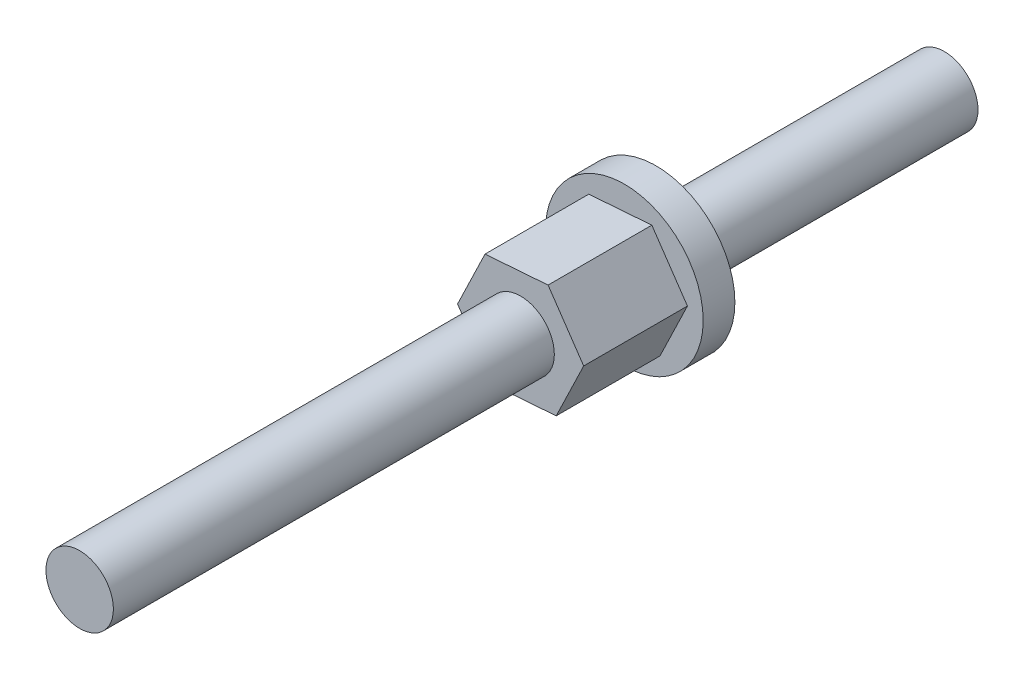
from build123d import *

# Parameters (mm, degrees)
BOSS_EXTRUDE1_DEPTH      = 50.8
BOSS_EXTRUDE1_DEPTH_BACK = 25.4
SKETCH1_R                = 2.9718
SKETCH3_R                = 6.9469
BOSS_EXTRUDE2_DEPTH      = 2.794
BOSS_EXTRUDE3_DEPTH      = 11.938


with BuildPart() as part:
    # Sketch1 → Boss-Extrude1 (new, two sides: drawn at the far end of the back side and taken through both)
    with BuildSketch(Plane.XY.offset(-BOSS_EXTRUDE1_DEPTH_BACK)):
        with Locations((70.174864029, 0)):
            Circle(SKETCH1_R)
    extrude(amount=BOSS_EXTRUDE1_DEPTH + BOSS_EXTRUDE1_DEPTH_BACK)

    # Sketch3 → Boss-Extrude2 (add)
    with BuildSketch(Plane.XY):
        with Locations((70.174864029, 0)):
            Circle(SKETCH3_R)
    extrude(amount=BOSS_EXTRUDE2_DEPTH)

    # Sketch2 → Boss-Extrude3 (add)
    with BuildSketch(Plane.XY):
        Polygon((73.311906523, -4.605720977), (75.732056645, 0.413898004), (72.595014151, 5.019618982), (67.037821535, 4.605720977), (64.617671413, -0.413898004), (67.754713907, -5.019618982), align=None)
    extrude(amount=BOSS_EXTRUDE3_DEPTH)


solid = part.part
